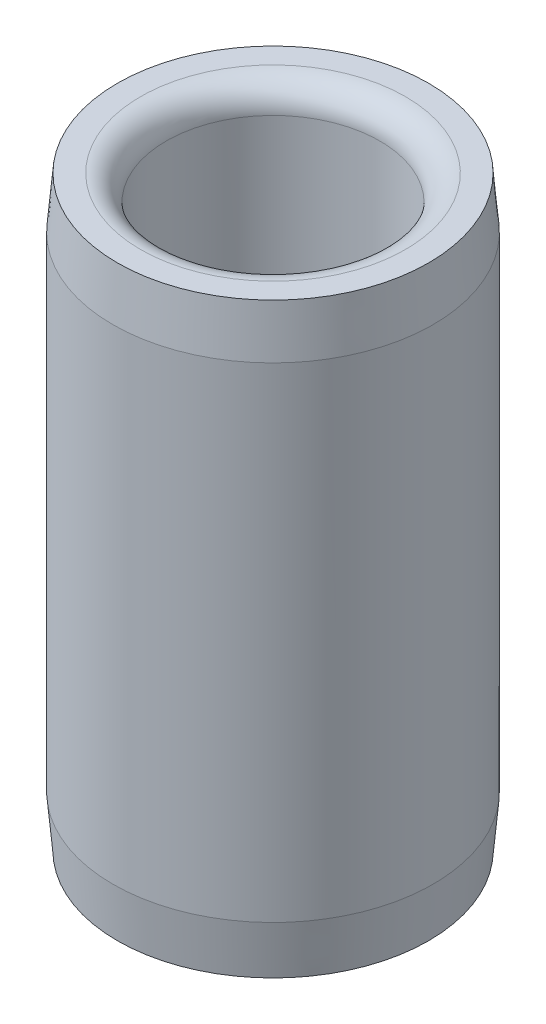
from build123d import *

# Parameters (mm, degrees)
SKETCH2_W      = 3.16865
SKETCH2_H      = 34.925
CHAMFER2_SIZE  = 3.048
CHAMFER2_SIZE2 = 0.266665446
FILLET1_R      = 1.524


with BuildPart() as part:
    # Sketch2 → Revolve1 (revolve)
    with BuildSketch(Plane.XY, mode=Mode.PRIVATE) as revolve1_sk:
        with Locations((-7.940675, 17.4625)):
            Rectangle(SKETCH2_W, SKETCH2_H)
    revolve(revolve1_sk.sketch.rotate(Axis((0, 20.080482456, 0), (0, -1, 0)), 270), axis=Axis((0, 20.080482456, 0), (0, -1, 0)))

    # Chamfer2
    chamfer2_edges = [part.edges().sort_by_distance(p)[0] for p in [
        (0, 34.925, -9.525),
        (0, 0, -9.525),
    ]]
    chamfer2_side = [part.faces().sort_by_distance(p)[0] for p in [
        (0, 17.4625, -9.525),
    ]]
    chamfer(chamfer2_edges, length=CHAMFER2_SIZE, length2=CHAMFER2_SIZE2, reference=chamfer2_side[0])

    # Fillet1
    fillet1_edges = [part.edges().sort_by_distance(p)[0] for p in [
        (0, 34.925, -6.35635),
        (0, 0, -6.35635),
    ]]
    fillet(fillet1_edges, radius=FILLET1_R)


solid = part.part
